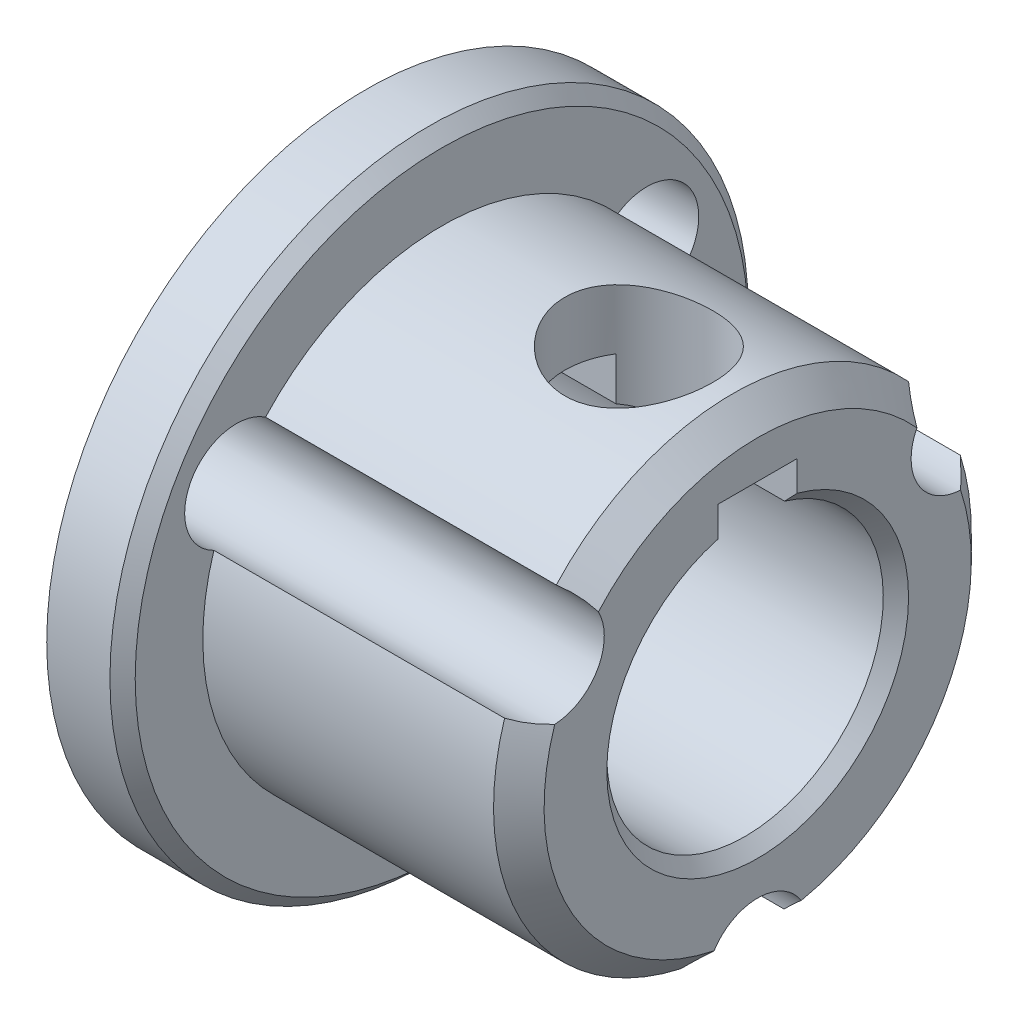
from build123d import *

# Parameters (mm, degrees)
CHAMFER1_SIZE      = 0.508
KEY_DEPTH          = 25.02214316
CHAMFER2_SIZE      = 1.016
SKETCH3_R          = 2.9718
SETSCREW_DEPTH     = 23.143935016
SKETCH4_R          = 2.0828
CUT_EXTRUDE3_DEPTH = 25.02214316


with BuildPart() as part:
    # Sketch1 → Base-Revolve (revolve)
    with BuildSketch(Plane.XY, mode=Mode.PRIVATE) as base_revolve_sk:
        Polygon((-3.048, 5.55625), (12.7, 5.55625), (12.7, 9.6012), (0, 9.6012), (0, 12.827), (-3.048, 12.827), align=None)
    revolve(base_revolve_sk.sketch.rotate(Axis((0, 0, 0), (1, 0, 0)), 90), axis=Axis((0, 0, 0), (1, 0, 0)))

    # Chamfer1
    chamfer1_edges = [part.edges().sort_by_distance(p)[0] for p in [
        (-3.048, 0, -5.55625),
        (12.7, 0, -5.55625),
        (0, 0, -12.827),
    ]]
    chamfer(chamfer1_edges, length=CHAMFER1_SIZE)

    # Sketch2 → Key (cut, through all)
    with BuildSketch(Plane.ZY.offset(3.048)):
        with BuildLine():
            Line((-1.5875, 5.324636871), (-1.5875, 7.0612))
            Line((-1.5875, 7.0612), (1.5875, 7.0612))
            Line((1.5875, 7.0612), (1.5875, 5.324636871))
            ThreePointArc((1.5875, 5.324636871), (0, 5.55625), (-1.5875, 5.324636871))
        make_face()
    extrude(amount=-KEY_DEPTH, mode=Mode.SUBTRACT)

    # Chamfer2
    chamfer2_edges = [part.edges().sort_by_distance(p)[0] for p in [
        (12.7, 0, -9.6012),
    ]]
    chamfer(chamfer2_edges, length=CHAMFER2_SIZE)

    # Sketch3 → SetScrew (cut, through all)
    with BuildSketch(Plane(origin=(0, 0, 0), x_dir=(1, 0, 0), z_dir=(0, 1, 0))):
        with Locations(Location((7.9248, 0, 0), (0, 0, 90))):
            Circle(SKETCH3_R)
    extrude(amount=SETSCREW_DEPTH, mode=Mode.SUBTRACT)

    # Sketch4 → Cut-Extrude3 (cut, through all)
    with BuildSketch(Plane.ZY.offset(3.048)):
        with Locations((0, -9.525)):
            Circle(SKETCH4_R)
        with Locations((-8.248891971, 4.7625)):
            Circle(SKETCH4_R)
        with Locations((8.248891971, 4.7625)):
            Circle(SKETCH4_R)
    extrude(amount=-CUT_EXTRUDE3_DEPTH, mode=Mode.SUBTRACT)


solid = part.part
